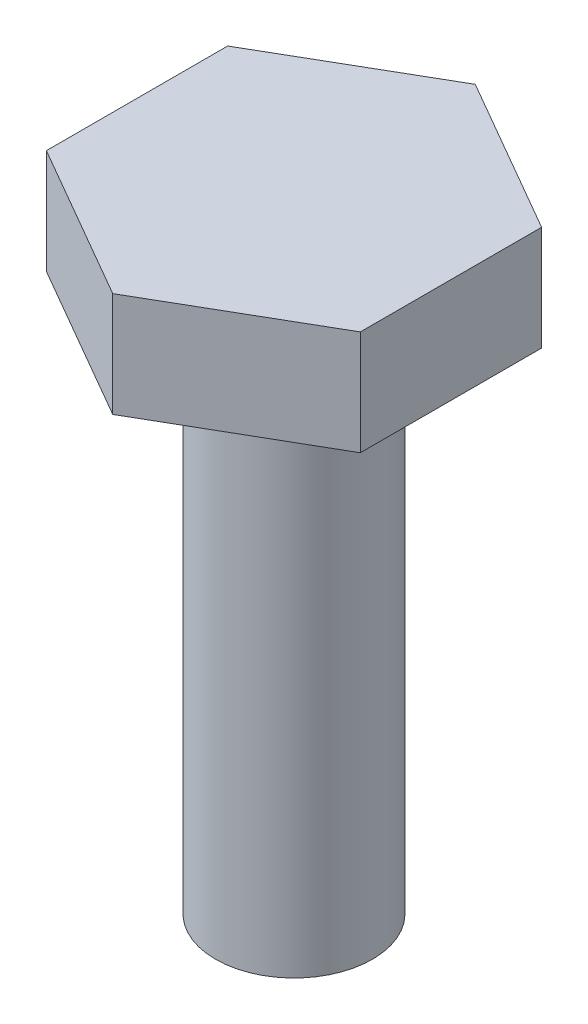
ISO-10303-21;
HEADER;
FILE_DESCRIPTION(('STEP AP214'),'2;1');
FILE_NAME('part.step','',(''),(''),'','','');
FILE_SCHEMA(('AUTOMOTIVE_DESIGN { 1 0 10303 214 1 1 1 1 }'));
ENDSEC;
DATA;
#1=APPLICATION_CONTEXT('core data for automotive mechanical design processes');
#2=APPLICATION_PROTOCOL_DEFINITION('international standard','automotive_design',2000,#1);
#3=PRODUCT_CONTEXT('',#1,'mechanical');
#4=PRODUCT('Part','Part','',(#3));
#5=PRODUCT_RELATED_PRODUCT_CATEGORY('part','',(#4));
#6=PRODUCT_DEFINITION_FORMATION('','',#4);
#7=PRODUCT_DEFINITION_CONTEXT('part definition',#1,'design');
#8=PRODUCT_DEFINITION('design','',#6,#7);
#9=PRODUCT_DEFINITION_SHAPE('','',#8);
#10=(LENGTH_UNIT() NAMED_UNIT(*) SI_UNIT(.MILLI.,.METRE.));
#11=(NAMED_UNIT(*) PLANE_ANGLE_UNIT() SI_UNIT($,.RADIAN.));
#12=(NAMED_UNIT(*) SI_UNIT($,.STERADIAN.) SOLID_ANGLE_UNIT());
#13=UNCERTAINTY_MEASURE_WITH_UNIT(LENGTH_MEASURE(1.E-05),#10,'distance_accuracy_value','');
#14=(GEOMETRIC_REPRESENTATION_CONTEXT(3) GLOBAL_UNCERTAINTY_ASSIGNED_CONTEXT((#13)) GLOBAL_UNIT_ASSIGNED_CONTEXT((#10,
#11,#12)) REPRESENTATION_CONTEXT('',''));
#15=CARTESIAN_POINT('',(0.,0.,0.));
#16=DIRECTION('',(0.,0.,1.));
#17=DIRECTION('',(1.,0.,0.));
#18=AXIS2_PLACEMENT_3D('',#15,#16,#17);
#19=CARTESIAN_POINT('',(5.99999999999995,4.,-3.46410161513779));
#20=DIRECTION('',(-0.499999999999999,0.,0.866025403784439));
#21=DIRECTION('',(0.866025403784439,0.,0.499999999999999));
#22=AXIS2_PLACEMENT_3D('',#19,#20,#21);
#23=PLANE('',#22);
#24=DIRECTION('',(-0.866025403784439,0.,-0.499999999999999));
#25=VECTOR('',#24,1.);
#26=CARTESIAN_POINT('',(5.99999999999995,0.,-3.46410161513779));
#27=LINE('',#26,#25);
#28=CARTESIAN_POINT('',(5.99999999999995,0.,-3.46410161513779));
#29=VERTEX_POINT('',#28);
#30=CARTESIAN_POINT('',(0.,0.,-6.9282032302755));
#31=VERTEX_POINT('',#30);
#32=EDGE_CURVE('E115',#29,#31,#27,.T.);
#33=ORIENTED_EDGE('',*,*,#32,.T.);
#34=DIRECTION('',(0.,-1.,0.));
#35=VECTOR('',#34,1.);
#36=CARTESIAN_POINT('',(0.,4.,-6.9282032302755));
#37=LINE('',#36,#35);
#38=CARTESIAN_POINT('',(0.,4.,-6.9282032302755));
#39=VERTEX_POINT('',#38);
#40=EDGE_CURVE('E11',#39,#31,#37,.T.);
#41=ORIENTED_EDGE('',*,*,#40,.F.);
#42=DIRECTION('',(-0.866025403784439,0.,-0.499999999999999));
#43=VECTOR('',#42,1.);
#44=CARTESIAN_POINT('',(5.99999999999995,4.,-3.46410161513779));
#45=LINE('',#44,#43);
#46=CARTESIAN_POINT('',(5.99999999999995,4.,-3.46410161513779));
#47=VERTEX_POINT('',#46);
#48=EDGE_CURVE('E126',#47,#39,#45,.T.);
#49=ORIENTED_EDGE('',*,*,#48,.F.);
#50=DIRECTION('',(0.,-1.,0.));
#51=VECTOR('',#50,1.);
#52=CARTESIAN_POINT('',(5.99999999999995,4.,-3.46410161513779));
#53=LINE('',#52,#51);
#54=EDGE_CURVE('E111',#47,#29,#53,.T.);
#55=ORIENTED_EDGE('',*,*,#54,.T.);
#56=EDGE_LOOP('',(#33,#41,#49,#55));
#57=FACE_BOUND('',#56,.T.);
#58=ADVANCED_FACE('F31',(#57),#23,.F.);
#59=CARTESIAN_POINT('',(0.,4.,-6.9282032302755));
#60=DIRECTION('',(0.499999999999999,0.,0.866025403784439));
#61=DIRECTION('',(0.866025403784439,0.,-0.499999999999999));
#62=AXIS2_PLACEMENT_3D('',#59,#60,#61);
#63=PLANE('',#62);
#64=DIRECTION('',(-0.866025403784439,0.,0.499999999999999));
#65=VECTOR('',#64,1.);
#66=CARTESIAN_POINT('',(0.,0.,-6.9282032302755));
#67=LINE('',#66,#65);
#68=CARTESIAN_POINT('',(-5.99999999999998,0.,-3.46410161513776));
#69=VERTEX_POINT('',#68);
#70=EDGE_CURVE('E118',#31,#69,#67,.T.);
#71=ORIENTED_EDGE('',*,*,#70,.T.);
#72=DIRECTION('',(0.,-1.,0.));
#73=VECTOR('',#72,1.);
#74=CARTESIAN_POINT('',(-5.99999999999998,4.,-3.46410161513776));
#75=LINE('',#74,#73);
#76=CARTESIAN_POINT('',(-5.99999999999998,4.,-3.46410161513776));
#77=VERTEX_POINT('',#76);
#78=EDGE_CURVE('E39',#77,#69,#75,.T.);
#79=ORIENTED_EDGE('',*,*,#78,.F.);
#80=DIRECTION('',(-0.866025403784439,0.,0.499999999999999));
#81=VECTOR('',#80,1.);
#82=CARTESIAN_POINT('',(0.,4.,-6.9282032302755));
#83=LINE('',#82,#81);
#84=EDGE_CURVE('E84',#39,#77,#83,.T.);
#85=ORIENTED_EDGE('',*,*,#84,.F.);
#86=ORIENTED_EDGE('',*,*,#40,.T.);
#87=EDGE_LOOP('',(#71,#79,#85,#86));
#88=FACE_BOUND('',#87,.T.);
#89=ADVANCED_FACE('F150',(#88),#63,.F.);
#90=CARTESIAN_POINT('',(-5.99999999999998,4.,-3.46410161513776));
#91=DIRECTION('',(1.,0.,0.));
#92=DIRECTION('',(0.,0.,-1.));
#93=AXIS2_PLACEMENT_3D('',#90,#91,#92);
#94=PLANE('',#93);
#95=DIRECTION('',(0.,0.,1.));
#96=VECTOR('',#95,1.);
#97=CARTESIAN_POINT('',(-5.99999999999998,0.,-3.46410161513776));
#98=LINE('',#97,#96);
#99=CARTESIAN_POINT('',(-5.99999999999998,0.,3.46410161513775));
#100=VERTEX_POINT('',#99);
#101=EDGE_CURVE('E121',#69,#100,#98,.T.);
#102=ORIENTED_EDGE('',*,*,#101,.T.);
#103=DIRECTION('',(0.,-1.,0.));
#104=VECTOR('',#103,1.);
#105=CARTESIAN_POINT('',(-5.99999999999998,4.,3.46410161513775));
#106=LINE('',#105,#104);
#107=CARTESIAN_POINT('',(-5.99999999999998,4.,3.46410161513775));
#108=VERTEX_POINT('',#107);
#109=EDGE_CURVE('E106',#108,#100,#106,.T.);
#110=ORIENTED_EDGE('',*,*,#109,.F.);
#111=DIRECTION('',(0.,0.,1.));
#112=VECTOR('',#111,1.);
#113=CARTESIAN_POINT('',(-5.99999999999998,4.,-3.46410161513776));
#114=LINE('',#113,#112);
#115=EDGE_CURVE('E97',#77,#108,#114,.T.);
#116=ORIENTED_EDGE('',*,*,#115,.F.);
#117=ORIENTED_EDGE('',*,*,#78,.T.);
#118=EDGE_LOOP('',(#102,#110,#116,#117));
#119=FACE_BOUND('',#118,.T.);
#120=ADVANCED_FACE('F132',(#119),#94,.F.);
#121=CARTESIAN_POINT('',(-5.99999999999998,4.,3.46410161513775));
#122=DIRECTION('',(0.499999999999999,0.,-0.866025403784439));
#123=DIRECTION('',(-0.866025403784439,0.,-0.499999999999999));
#124=AXIS2_PLACEMENT_3D('',#121,#122,#123);
#125=PLANE('',#124);
#126=DIRECTION('',(0.866025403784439,0.,0.499999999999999));
#127=VECTOR('',#126,1.);
#128=CARTESIAN_POINT('',(-5.99999999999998,0.,3.46410161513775));
#129=LINE('',#128,#127);
#130=CARTESIAN_POINT('',(0.,0.,6.92820323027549));
#131=VERTEX_POINT('',#130);
#132=EDGE_CURVE('E105',#100,#131,#129,.T.);
#133=ORIENTED_EDGE('',*,*,#132,.T.);
#134=DIRECTION('',(0.,-1.,0.));
#135=VECTOR('',#134,1.);
#136=CARTESIAN_POINT('',(0.,4.,6.92820323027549));
#137=LINE('',#136,#135);
#138=CARTESIAN_POINT('',(0.,4.,6.92820323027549));
#139=VERTEX_POINT('',#138);
#140=EDGE_CURVE('E102',#139,#131,#137,.T.);
#141=ORIENTED_EDGE('',*,*,#140,.F.);
#142=DIRECTION('',(0.866025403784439,0.,0.499999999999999));
#143=VECTOR('',#142,1.);
#144=CARTESIAN_POINT('',(-5.99999999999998,4.,3.46410161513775));
#145=LINE('',#144,#143);
#146=EDGE_CURVE('E91',#108,#139,#145,.T.);
#147=ORIENTED_EDGE('',*,*,#146,.F.);
#148=ORIENTED_EDGE('',*,*,#109,.T.);
#149=EDGE_LOOP('',(#133,#141,#147,#148));
#150=FACE_BOUND('',#149,.T.);
#151=ADVANCED_FACE('F103',(#150),#125,.F.);
#152=CARTESIAN_POINT('',(0.,4.,6.92820323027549));
#153=DIRECTION('',(-0.5,0.,-0.866025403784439));
#154=DIRECTION('',(-0.866025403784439,0.,0.5));
#155=AXIS2_PLACEMENT_3D('',#152,#153,#154);
#156=PLANE('',#155);
#157=DIRECTION('',(0.866025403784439,0.,-0.5));
#158=VECTOR('',#157,1.);
#159=CARTESIAN_POINT('',(0.,0.,6.92820323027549));
#160=LINE('',#159,#158);
#161=CARTESIAN_POINT('',(5.99999999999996,0.,3.46410161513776));
#162=VERTEX_POINT('',#161);
#163=EDGE_CURVE('E70',#131,#162,#160,.T.);
#164=ORIENTED_EDGE('',*,*,#163,.T.);
#165=DIRECTION('',(0.,-1.,0.));
#166=VECTOR('',#165,1.);
#167=CARTESIAN_POINT('',(5.99999999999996,4.,3.46410161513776));
#168=LINE('',#167,#166);
#169=CARTESIAN_POINT('',(5.99999999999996,4.,3.46410161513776));
#170=VERTEX_POINT('',#169);
#171=EDGE_CURVE('E107',#170,#162,#168,.T.);
#172=ORIENTED_EDGE('',*,*,#171,.F.);
#173=DIRECTION('',(0.866025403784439,0.,-0.5));
#174=VECTOR('',#173,1.);
#175=CARTESIAN_POINT('',(0.,4.,6.92820323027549));
#176=LINE('',#175,#174);
#177=EDGE_CURVE('E95',#139,#170,#176,.T.);
#178=ORIENTED_EDGE('',*,*,#177,.F.);
#179=ORIENTED_EDGE('',*,*,#140,.T.);
#180=EDGE_LOOP('',(#164,#172,#178,#179));
#181=FACE_BOUND('',#180,.T.);
#182=ADVANCED_FACE('F109',(#181),#156,.F.);
#183=CARTESIAN_POINT('',(5.99999999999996,4.,3.46410161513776));
#184=DIRECTION('',(-1.,0.,0.));
#185=DIRECTION('',(0.,0.,1.));
#186=AXIS2_PLACEMENT_3D('',#183,#184,#185);
#187=PLANE('',#186);
#188=DIRECTION('',(0.,0.,-1.));
#189=VECTOR('',#188,1.);
#190=CARTESIAN_POINT('',(5.99999999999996,0.,3.46410161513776));
#191=LINE('',#190,#189);
#192=EDGE_CURVE('E76',#162,#29,#191,.T.);
#193=ORIENTED_EDGE('',*,*,#192,.T.);
#194=ORIENTED_EDGE('',*,*,#54,.F.);
#195=DIRECTION('',(0.,0.,-1.));
#196=VECTOR('',#195,1.);
#197=CARTESIAN_POINT('',(5.99999999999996,4.,3.46410161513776));
#198=LINE('',#197,#196);
#199=EDGE_CURVE('E47',#170,#47,#198,.T.);
#200=ORIENTED_EDGE('',*,*,#199,.F.);
#201=ORIENTED_EDGE('',*,*,#171,.T.);
#202=EDGE_LOOP('',(#193,#194,#200,#201));
#203=FACE_BOUND('',#202,.T.);
#204=ADVANCED_FACE('F139',(#203),#187,.F.);
#205=CARTESIAN_POINT('',(-5.99999999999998,4.,-10.3923048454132));
#206=DIRECTION('',(0.,1.,0.));
#207=DIRECTION('',(0.,0.,1.));
#208=AXIS2_PLACEMENT_3D('',#205,#206,#207);
#209=PLANE('',#208);
#210=ORIENTED_EDGE('',*,*,#48,.T.);
#211=ORIENTED_EDGE('',*,*,#84,.T.);
#212=ORIENTED_EDGE('',*,*,#115,.T.);
#213=ORIENTED_EDGE('',*,*,#146,.T.);
#214=ORIENTED_EDGE('',*,*,#177,.T.);
#215=ORIENTED_EDGE('',*,*,#199,.T.);
#216=EDGE_LOOP('',(#210,#211,#212,#213,#214,#215));
#217=FACE_BOUND('',#216,.T.);
#218=ADVANCED_FACE('F93',(#217),#209,.T.);
#219=CARTESIAN_POINT('',(-5.99999999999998,0.,-10.3923048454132));
#220=DIRECTION('',(0.,1.,0.));
#221=DIRECTION('',(0.,0.,1.));
#222=AXIS2_PLACEMENT_3D('',#219,#220,#221);
#223=PLANE('',#222);
#224=CARTESIAN_POINT('',(0.,0.,0.));
#225=DIRECTION('',(0.,1.,0.));
#226=DIRECTION('',(0.,0.,1.));
#227=AXIS2_PLACEMENT_3D('',#224,#225,#226);
#228=CIRCLE('',#227,3.);
#229=CARTESIAN_POINT('',(0.,0.,3.));
#230=VERTEX_POINT('',#229);
#231=EDGE_CURVE('E212',#230,#230,#228,.T.);
#232=ORIENTED_EDGE('',*,*,#231,.T.);
#233=EDGE_LOOP('',(#232));
#234=FACE_BOUND('',#233,.T.);
#235=ORIENTED_EDGE('',*,*,#32,.F.);
#236=ORIENTED_EDGE('',*,*,#192,.F.);
#237=ORIENTED_EDGE('',*,*,#163,.F.);
#238=ORIENTED_EDGE('',*,*,#132,.F.);
#239=ORIENTED_EDGE('',*,*,#101,.F.);
#240=ORIENTED_EDGE('',*,*,#70,.F.);
#241=EDGE_LOOP('',(#235,#236,#237,#238,#239,#240));
#242=FACE_BOUND('',#241,.T.);
#243=ADVANCED_FACE('F135',(#234,#242),#223,.F.);
#244=CARTESIAN_POINT('',(0.,-20.,0.));
#245=DIRECTION('',(0.,1.,0.));
#246=DIRECTION('',(0.,0.,1.));
#247=AXIS2_PLACEMENT_3D('',#244,#245,#246);
#248=CYLINDRICAL_SURFACE('',#247,3.);
#249=CARTESIAN_POINT('',(0.,-20.,0.));
#250=DIRECTION('',(0.,1.,0.));
#251=DIRECTION('',(0.,0.,1.));
#252=AXIS2_PLACEMENT_3D('',#249,#250,#251);
#253=CIRCLE('',#252,3.);
#254=CARTESIAN_POINT('',(0.,-20.,3.));
#255=VERTEX_POINT('',#254);
#256=EDGE_CURVE('E119',#255,#255,#253,.T.);
#257=ORIENTED_EDGE('',*,*,#256,.T.);
#258=EDGE_LOOP('',(#257));
#259=FACE_BOUND('',#258,.T.);
#260=ORIENTED_EDGE('',*,*,#231,.F.);
#261=EDGE_LOOP('',(#260));
#262=FACE_BOUND('',#261,.T.);
#263=ADVANCED_FACE('F187',(#259,#262),#248,.T.);
#264=CARTESIAN_POINT('',(0.,-20.,0.));
#265=DIRECTION('',(0.,1.,0.));
#266=DIRECTION('',(0.,0.,1.));
#267=AXIS2_PLACEMENT_3D('',#264,#265,#266);
#268=PLANE('',#267);
#269=ORIENTED_EDGE('',*,*,#256,.F.);
#270=EDGE_LOOP('',(#269));
#271=FACE_BOUND('',#270,.T.);
#272=ADVANCED_FACE('F196',(#271),#268,.F.);
#273=CLOSED_SHELL('',(#58,#89,#120,#151,#182,#204,#218,#243,#263,#272));
#274=MANIFOLD_SOLID_BREP('B2',#273);
#275=ADVANCED_BREP_SHAPE_REPRESENTATION('',(#18,#274),#14);
#276=SHAPE_DEFINITION_REPRESENTATION(#9,#275);
ENDSEC;
END-ISO-10303-21;
